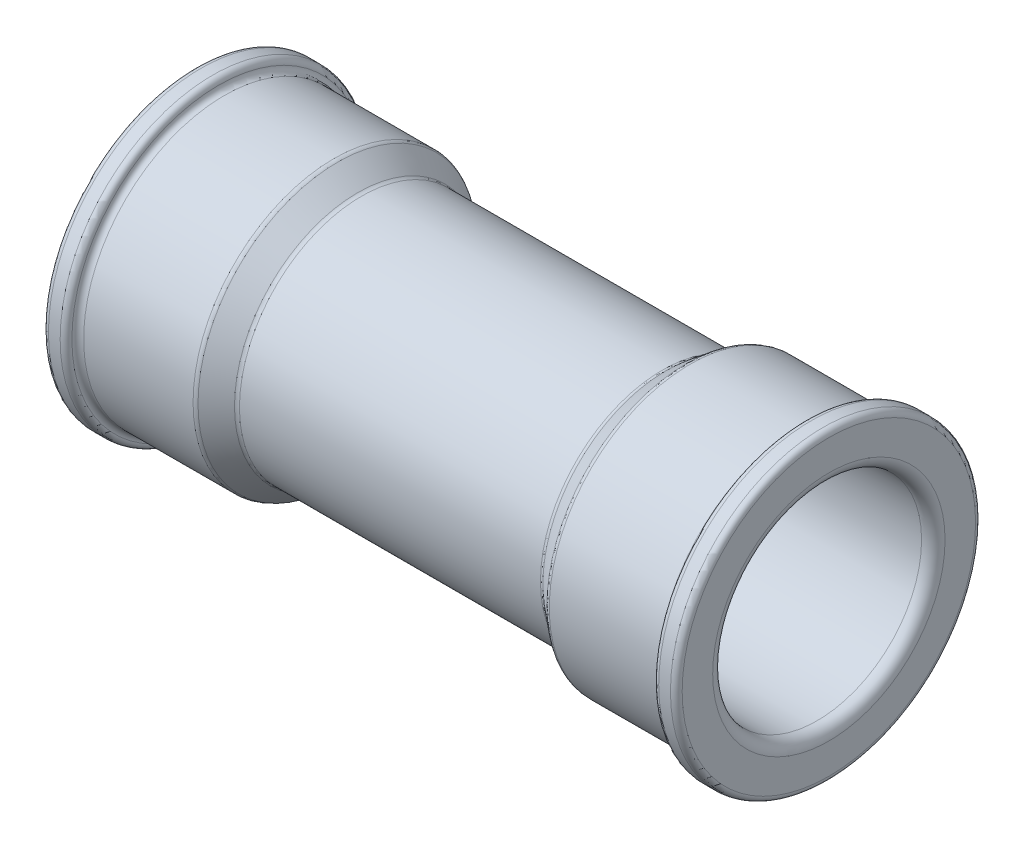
ISO-10303-21;
HEADER;
FILE_DESCRIPTION(('STEP AP214'),'2;1');
FILE_NAME('part.step','',(''),(''),'','','');
FILE_SCHEMA(('AUTOMOTIVE_DESIGN { 1 0 10303 214 1 1 1 1 }'));
ENDSEC;
DATA;
#1=APPLICATION_CONTEXT('core data for automotive mechanical design processes');
#2=APPLICATION_PROTOCOL_DEFINITION('international standard','automotive_design',2000,#1);
#3=PRODUCT_CONTEXT('',#1,'mechanical');
#4=PRODUCT('Part','Part','',(#3));
#5=PRODUCT_RELATED_PRODUCT_CATEGORY('part','',(#4));
#6=PRODUCT_DEFINITION_FORMATION('','',#4);
#7=PRODUCT_DEFINITION_CONTEXT('part definition',#1,'design');
#8=PRODUCT_DEFINITION('design','',#6,#7);
#9=PRODUCT_DEFINITION_SHAPE('','',#8);
#10=(LENGTH_UNIT() NAMED_UNIT(*) SI_UNIT(.MILLI.,.METRE.));
#11=(NAMED_UNIT(*) PLANE_ANGLE_UNIT() SI_UNIT($,.RADIAN.));
#12=(NAMED_UNIT(*) SI_UNIT($,.STERADIAN.) SOLID_ANGLE_UNIT());
#13=UNCERTAINTY_MEASURE_WITH_UNIT(LENGTH_MEASURE(1.E-05),#10,'distance_accuracy_value','');
#14=(GEOMETRIC_REPRESENTATION_CONTEXT(3) GLOBAL_UNCERTAINTY_ASSIGNED_CONTEXT((#13)) GLOBAL_UNIT_ASSIGNED_CONTEXT((#10,
#11,#12)) REPRESENTATION_CONTEXT('',''));
#15=CARTESIAN_POINT('',(0.,0.,0.));
#16=DIRECTION('',(0.,0.,1.));
#17=DIRECTION('',(1.,0.,0.));
#18=AXIS2_PLACEMENT_3D('',#15,#16,#17);
#19=CARTESIAN_POINT('',(0.,0.,0.));
#20=DIRECTION('',(1.,0.,0.));
#21=DIRECTION('',(0.,0.,-1.));
#22=AXIS2_PLACEMENT_3D('',#19,#20,#21);
#23=CYLINDRICAL_SURFACE('',#22,10.4);
#24=CARTESIAN_POINT('',(-12.8246094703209,0.,0.));
#25=DIRECTION('',(1.,0.,0.));
#26=DIRECTION('',(0.,0.,-1.));
#27=AXIS2_PLACEMENT_3D('',#24,#25,#26);
#28=CIRCLE('',#27,10.4);
#29=CARTESIAN_POINT('',(-12.8246094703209,0.,-10.4));
#30=VERTEX_POINT('',#29);
#31=EDGE_CURVE('E186',#30,#30,#28,.T.);
#32=ORIENTED_EDGE('',*,*,#31,.T.);
#33=EDGE_LOOP('',(#32));
#34=FACE_BOUND('',#33,.T.);
#35=CARTESIAN_POINT('',(12.8246094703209,0.,0.));
#36=DIRECTION('',(1.,0.,0.));
#37=DIRECTION('',(0.,0.,-1.));
#38=AXIS2_PLACEMENT_3D('',#35,#36,#37);
#39=CIRCLE('',#38,10.4);
#40=CARTESIAN_POINT('',(12.8246094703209,0.,-10.4));
#41=VERTEX_POINT('',#40);
#42=EDGE_CURVE('E189',#41,#41,#39,.F.);
#43=ORIENTED_EDGE('',*,*,#42,.T.);
#44=EDGE_LOOP('',(#43));
#45=FACE_BOUND('',#44,.T.);
#46=ADVANCED_FACE('F17',(#34,#45),#23,.T.);
#47=CARTESIAN_POINT('',(12.8246094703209,0.,0.));
#48=DIRECTION('',(1.,0.,0.));
#49=DIRECTION('',(0.,0.,-1.));
#50=AXIS2_PLACEMENT_3D('',#47,#48,#49);
#51=TOROIDAL_SURFACE('',#50,10.9,0.5);
#52=ORIENTED_EDGE('',*,*,#42,.F.);
#53=EDGE_LOOP('',(#52));
#54=FACE_BOUND('',#53,.T.);
#55=CARTESIAN_POINT('',(13.1369569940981,0.,0.));
#56=DIRECTION('',(1.,0.,0.));
#57=DIRECTION('',(0.,0.,-1.));
#58=AXIS2_PLACEMENT_3D('',#55,#56,#57);
#59=CIRCLE('',#58,10.5095655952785);
#60=CARTESIAN_POINT('',(13.1369569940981,0.,-10.5095655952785));
#61=VERTEX_POINT('',#60);
#62=EDGE_CURVE('E172',#61,#61,#59,.T.);
#63=ORIENTED_EDGE('',*,*,#62,.F.);
#64=EDGE_LOOP('',(#63));
#65=FACE_BOUND('',#64,.T.);
#66=ADVANCED_FACE('F180',(#54,#65),#51,.F.);
#67=CARTESIAN_POINT('',(-12.8246094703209,0.,0.));
#68=DIRECTION('',(1.,0.,0.));
#69=DIRECTION('',(0.,0.,-1.));
#70=AXIS2_PLACEMENT_3D('',#67,#68,#69);
#71=TOROIDAL_SURFACE('',#70,10.9,0.5);
#72=CARTESIAN_POINT('',(-13.1369569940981,0.,0.));
#73=DIRECTION('',(-1.,0.,0.));
#74=DIRECTION('',(0.,0.,1.));
#75=AXIS2_PLACEMENT_3D('',#72,#73,#74);
#76=CIRCLE('',#75,10.5095655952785);
#77=CARTESIAN_POINT('',(-13.1369569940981,0.,10.5095655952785));
#78=VERTEX_POINT('',#77);
#79=EDGE_CURVE('E169',#78,#78,#76,.T.);
#80=ORIENTED_EDGE('',*,*,#79,.F.);
#81=EDGE_LOOP('',(#80));
#82=FACE_BOUND('',#81,.T.);
#83=ORIENTED_EDGE('',*,*,#31,.F.);
#84=EDGE_LOOP('',(#83));
#85=FACE_BOUND('',#84,.T.);
#86=ADVANCED_FACE('F177',(#82,#85),#71,.F.);
#87=CARTESIAN_POINT('',(14.8630430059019,0.,0.));
#88=DIRECTION('',(1.,0.,0.));
#89=DIRECTION('',(0.,0.,-1.));
#90=AXIS2_PLACEMENT_3D('',#87,#88,#89);
#91=CONICAL_SURFACE('',#90,11.8904344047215,0.674740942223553);
#92=ORIENTED_EDGE('',*,*,#62,.T.);
#93=EDGE_LOOP('',(#92));
#94=FACE_BOUND('',#93,.T.);
#95=CARTESIAN_POINT('',(14.8630430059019,0.,0.));
#96=DIRECTION('',(-1.,0.,0.));
#97=DIRECTION('',(0.,0.,1.));
#98=AXIS2_PLACEMENT_3D('',#95,#96,#97);
#99=CIRCLE('',#98,11.8904344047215);
#100=CARTESIAN_POINT('',(14.8630430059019,0.,11.8904344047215));
#101=VERTEX_POINT('',#100);
#102=EDGE_CURVE('E166',#101,#101,#99,.F.);
#103=ORIENTED_EDGE('',*,*,#102,.F.);
#104=EDGE_LOOP('',(#103));
#105=FACE_BOUND('',#104,.T.);
#106=ADVANCED_FACE('F179',(#94,#105),#91,.T.);
#107=CARTESIAN_POINT('',(-14.8630430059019,0.,0.));
#108=DIRECTION('',(-1.,0.,0.));
#109=DIRECTION('',(0.,0.,1.));
#110=AXIS2_PLACEMENT_3D('',#107,#108,#109);
#111=CONICAL_SURFACE('',#110,11.8904344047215,0.674740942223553);
#112=ORIENTED_EDGE('',*,*,#79,.T.);
#113=EDGE_LOOP('',(#112));
#114=FACE_BOUND('',#113,.T.);
#115=CARTESIAN_POINT('',(-14.8630430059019,0.,0.));
#116=DIRECTION('',(-1.,0.,0.));
#117=DIRECTION('',(0.,0.,1.));
#118=AXIS2_PLACEMENT_3D('',#115,#116,#117);
#119=CIRCLE('',#118,11.8904344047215);
#120=CARTESIAN_POINT('',(-14.8630430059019,0.,11.8904344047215));
#121=VERTEX_POINT('',#120);
#122=EDGE_CURVE('E163',#121,#121,#119,.T.);
#123=ORIENTED_EDGE('',*,*,#122,.F.);
#124=EDGE_LOOP('',(#123));
#125=FACE_BOUND('',#124,.T.);
#126=ADVANCED_FACE('F157',(#114,#125),#111,.T.);
#127=CARTESIAN_POINT('',(15.1753905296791,0.,0.));
#128=DIRECTION('',(-1.,0.,0.));
#129=DIRECTION('',(0.,0.,1.));
#130=AXIS2_PLACEMENT_3D('',#127,#128,#129);
#131=TOROIDAL_SURFACE('',#130,11.5,0.5);
#132=CARTESIAN_POINT('',(15.1753905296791,0.,0.));
#133=DIRECTION('',(1.,0.,0.));
#134=DIRECTION('',(0.,0.,-1.));
#135=AXIS2_PLACEMENT_3D('',#132,#133,#134);
#136=CIRCLE('',#135,12.);
#137=CARTESIAN_POINT('',(15.1753905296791,0.,-12.));
#138=VERTEX_POINT('',#137);
#139=EDGE_CURVE('E162',#138,#138,#136,.T.);
#140=ORIENTED_EDGE('',*,*,#139,.F.);
#141=EDGE_LOOP('',(#140));
#142=FACE_BOUND('',#141,.T.);
#143=ORIENTED_EDGE('',*,*,#102,.T.);
#144=EDGE_LOOP('',(#143));
#145=FACE_BOUND('',#144,.T.);
#146=ADVANCED_FACE('F152',(#142,#145),#131,.T.);
#147=CARTESIAN_POINT('',(-15.1753905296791,0.,0.));
#148=DIRECTION('',(-1.,0.,0.));
#149=DIRECTION('',(0.,0.,1.));
#150=AXIS2_PLACEMENT_3D('',#147,#148,#149);
#151=TOROIDAL_SURFACE('',#150,11.5,0.5);
#152=ORIENTED_EDGE('',*,*,#122,.T.);
#153=EDGE_LOOP('',(#152));
#154=FACE_BOUND('',#153,.T.);
#155=CARTESIAN_POINT('',(-15.1753905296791,0.,0.));
#156=DIRECTION('',(1.,0.,0.));
#157=DIRECTION('',(0.,0.,-1.));
#158=AXIS2_PLACEMENT_3D('',#155,#156,#157);
#159=CIRCLE('',#158,12.);
#160=CARTESIAN_POINT('',(-15.1753905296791,0.,-12.));
#161=VERTEX_POINT('',#160);
#162=EDGE_CURVE('E143',#161,#161,#159,.F.);
#163=ORIENTED_EDGE('',*,*,#162,.F.);
#164=EDGE_LOOP('',(#163));
#165=FACE_BOUND('',#164,.T.);
#166=ADVANCED_FACE('F148',(#154,#165),#151,.T.);
#167=CARTESIAN_POINT('',(0.,0.,0.));
#168=DIRECTION('',(1.,0.,0.));
#169=DIRECTION('',(0.,0.,-1.));
#170=AXIS2_PLACEMENT_3D('',#167,#168,#169);
#171=CYLINDRICAL_SURFACE('',#170,12.);
#172=ORIENTED_EDGE('',*,*,#139,.T.);
#173=EDGE_LOOP('',(#172));
#174=FACE_BOUND('',#173,.T.);
#175=CARTESIAN_POINT('',(24.5,0.,0.));
#176=DIRECTION('',(-1.,0.,0.));
#177=DIRECTION('',(0.,0.,1.));
#178=AXIS2_PLACEMENT_3D('',#175,#176,#177);
#179=CIRCLE('',#178,12.);
#180=CARTESIAN_POINT('',(24.5,0.,12.));
#181=VERTEX_POINT('',#180);
#182=EDGE_CURVE('E140',#181,#181,#179,.T.);
#183=ORIENTED_EDGE('',*,*,#182,.T.);
#184=EDGE_LOOP('',(#183));
#185=FACE_BOUND('',#184,.T.);
#186=ADVANCED_FACE('F151',(#174,#185),#171,.T.);
#187=CARTESIAN_POINT('',(0.,0.,0.));
#188=DIRECTION('',(1.,0.,0.));
#189=DIRECTION('',(0.,0.,-1.));
#190=AXIS2_PLACEMENT_3D('',#187,#188,#189);
#191=CYLINDRICAL_SURFACE('',#190,12.);
#192=CARTESIAN_POINT('',(-24.5,0.,0.));
#193=DIRECTION('',(1.,0.,0.));
#194=DIRECTION('',(0.,0.,-1.));
#195=AXIS2_PLACEMENT_3D('',#192,#193,#194);
#196=CIRCLE('',#195,12.);
#197=CARTESIAN_POINT('',(-24.5,0.,-12.));
#198=VERTEX_POINT('',#197);
#199=EDGE_CURVE('E137',#198,#198,#196,.T.);
#200=ORIENTED_EDGE('',*,*,#199,.T.);
#201=EDGE_LOOP('',(#200));
#202=FACE_BOUND('',#201,.T.);
#203=ORIENTED_EDGE('',*,*,#162,.T.);
#204=EDGE_LOOP('',(#203));
#205=FACE_BOUND('',#204,.T.);
#206=ADVANCED_FACE('F129',(#202,#205),#191,.T.);
#207=CARTESIAN_POINT('',(24.5,0.,0.));
#208=DIRECTION('',(-1.,0.,0.));
#209=DIRECTION('',(0.,0.,1.));
#210=AXIS2_PLACEMENT_3D('',#207,#208,#209);
#211=TOROIDAL_SURFACE('',#210,12.5,0.5);
#212=CARTESIAN_POINT('',(25.,0.,0.));
#213=DIRECTION('',(-1.,0.,0.));
#214=DIRECTION('',(0.,0.,1.));
#215=AXIS2_PLACEMENT_3D('',#212,#213,#214);
#216=CIRCLE('',#215,12.5);
#217=CARTESIAN_POINT('',(25.,0.,12.5));
#218=VERTEX_POINT('',#217);
#219=EDGE_CURVE('E134',#218,#218,#216,.F.);
#220=ORIENTED_EDGE('',*,*,#219,.F.);
#221=EDGE_LOOP('',(#220));
#222=FACE_BOUND('',#221,.T.);
#223=ORIENTED_EDGE('',*,*,#182,.F.);
#224=EDGE_LOOP('',(#223));
#225=FACE_BOUND('',#224,.T.);
#226=ADVANCED_FACE('F125',(#222,#225),#211,.F.);
#227=CARTESIAN_POINT('',(-24.5,0.,0.));
#228=DIRECTION('',(1.,0.,0.));
#229=DIRECTION('',(0.,0.,-1.));
#230=AXIS2_PLACEMENT_3D('',#227,#228,#229);
#231=TOROIDAL_SURFACE('',#230,12.5,0.5);
#232=CARTESIAN_POINT('',(-25.,0.,0.));
#233=DIRECTION('',(1.,0.,0.));
#234=DIRECTION('',(0.,0.,-1.));
#235=AXIS2_PLACEMENT_3D('',#232,#233,#234);
#236=CIRCLE('',#235,12.5);
#237=CARTESIAN_POINT('',(-25.,0.,-12.5));
#238=VERTEX_POINT('',#237);
#239=EDGE_CURVE('E116',#238,#238,#236,.F.);
#240=ORIENTED_EDGE('',*,*,#239,.F.);
#241=EDGE_LOOP('',(#240));
#242=FACE_BOUND('',#241,.T.);
#243=ORIENTED_EDGE('',*,*,#199,.F.);
#244=EDGE_LOOP('',(#243));
#245=FACE_BOUND('',#244,.T.);
#246=ADVANCED_FACE('F122',(#242,#245),#231,.F.);
#247=CARTESIAN_POINT('',(25.5,0.,0.));
#248=DIRECTION('',(-1.,0.,0.));
#249=DIRECTION('',(0.,0.,1.));
#250=AXIS2_PLACEMENT_3D('',#247,#248,#249);
#251=TOROIDAL_SURFACE('',#250,12.5,0.5);
#252=CARTESIAN_POINT('',(25.5,0.,0.));
#253=DIRECTION('',(1.,0.,0.));
#254=DIRECTION('',(0.,0.,-1.));
#255=AXIS2_PLACEMENT_3D('',#252,#253,#254);
#256=CIRCLE('',#255,13.);
#257=CARTESIAN_POINT('',(25.5,0.,-13.));
#258=VERTEX_POINT('',#257);
#259=EDGE_CURVE('E114',#258,#258,#256,.T.);
#260=ORIENTED_EDGE('',*,*,#259,.F.);
#261=EDGE_LOOP('',(#260));
#262=FACE_BOUND('',#261,.T.);
#263=ORIENTED_EDGE('',*,*,#219,.T.);
#264=EDGE_LOOP('',(#263));
#265=FACE_BOUND('',#264,.T.);
#266=ADVANCED_FACE('F104',(#262,#265),#251,.T.);
#267=CARTESIAN_POINT('',(-25.5,0.,0.));
#268=DIRECTION('',(1.,0.,0.));
#269=DIRECTION('',(0.,0.,-1.));
#270=AXIS2_PLACEMENT_3D('',#267,#268,#269);
#271=TOROIDAL_SURFACE('',#270,12.5,0.5);
#272=CARTESIAN_POINT('',(-25.5,0.,0.));
#273=DIRECTION('',(1.,0.,0.));
#274=DIRECTION('',(0.,0.,-1.));
#275=AXIS2_PLACEMENT_3D('',#272,#273,#274);
#276=CIRCLE('',#275,13.);
#277=CARTESIAN_POINT('',(-25.5,0.,-13.));
#278=VERTEX_POINT('',#277);
#279=EDGE_CURVE('E111',#278,#278,#276,.F.);
#280=ORIENTED_EDGE('',*,*,#279,.F.);
#281=EDGE_LOOP('',(#280));
#282=FACE_BOUND('',#281,.T.);
#283=ORIENTED_EDGE('',*,*,#239,.T.);
#284=EDGE_LOOP('',(#283));
#285=FACE_BOUND('',#284,.T.);
#286=ADVANCED_FACE('F99',(#282,#285),#271,.T.);
#287=CARTESIAN_POINT('',(0.,0.,0.));
#288=DIRECTION('',(1.,0.,0.));
#289=DIRECTION('',(0.,0.,-1.));
#290=AXIS2_PLACEMENT_3D('',#287,#288,#289);
#291=CYLINDRICAL_SURFACE('',#290,13.);
#292=ORIENTED_EDGE('',*,*,#259,.T.);
#293=EDGE_LOOP('',(#292));
#294=FACE_BOUND('',#293,.T.);
#295=CARTESIAN_POINT('',(26.5,0.,0.));
#296=DIRECTION('',(1.,0.,0.));
#297=DIRECTION('',(0.,0.,-1.));
#298=AXIS2_PLACEMENT_3D('',#295,#296,#297);
#299=CIRCLE('',#298,13.);
#300=CARTESIAN_POINT('',(26.5,0.,-13.));
#301=VERTEX_POINT('',#300);
#302=EDGE_CURVE('E110',#301,#301,#299,.T.);
#303=ORIENTED_EDGE('',*,*,#302,.F.);
#304=EDGE_LOOP('',(#303));
#305=FACE_BOUND('',#304,.T.);
#306=ADVANCED_FACE('F95',(#294,#305),#291,.T.);
#307=CARTESIAN_POINT('',(0.,0.,0.));
#308=DIRECTION('',(1.,0.,0.));
#309=DIRECTION('',(0.,0.,-1.));
#310=AXIS2_PLACEMENT_3D('',#307,#308,#309);
#311=CYLINDRICAL_SURFACE('',#310,13.);
#312=CARTESIAN_POINT('',(-26.5,0.,0.));
#313=DIRECTION('',(-1.,0.,0.));
#314=DIRECTION('',(0.,0.,1.));
#315=AXIS2_PLACEMENT_3D('',#312,#313,#314);
#316=CIRCLE('',#315,13.);
#317=CARTESIAN_POINT('',(-26.5,0.,13.));
#318=VERTEX_POINT('',#317);
#319=EDGE_CURVE('E64',#318,#318,#316,.T.);
#320=ORIENTED_EDGE('',*,*,#319,.F.);
#321=EDGE_LOOP('',(#320));
#322=FACE_BOUND('',#321,.T.);
#323=ORIENTED_EDGE('',*,*,#279,.T.);
#324=EDGE_LOOP('',(#323));
#325=FACE_BOUND('',#324,.T.);
#326=ADVANCED_FACE('F87',(#322,#325),#311,.T.);
#327=CARTESIAN_POINT('',(26.5,0.,0.));
#328=DIRECTION('',(1.,0.,0.));
#329=DIRECTION('',(0.,0.,-1.));
#330=AXIS2_PLACEMENT_3D('',#327,#328,#329);
#331=TOROIDAL_SURFACE('',#330,12.5,0.5);
#332=ORIENTED_EDGE('',*,*,#302,.T.);
#333=EDGE_LOOP('',(#332));
#334=FACE_BOUND('',#333,.T.);
#335=CARTESIAN_POINT('',(27.,0.,0.));
#336=DIRECTION('',(-1.,0.,0.));
#337=DIRECTION('',(0.,0.,-1.));
#338=AXIS2_PLACEMENT_3D('',#335,#336,#337);
#339=CIRCLE('',#338,12.5);
#340=CARTESIAN_POINT('',(27.,0.,12.5));
#341=VERTEX_POINT('',#340);
#342=CARTESIAN_POINT('',(27.,0.,-12.5));
#343=VERTEX_POINT('',#342);
#344=EDGE_CURVE('E57',#341,#343,#339,.F.);
#345=ORIENTED_EDGE('',*,*,#344,.F.);
#346=CARTESIAN_POINT('',(27.,0.,0.));
#347=DIRECTION('',(-1.,0.,0.));
#348=DIRECTION('',(0.,0.,1.));
#349=AXIS2_PLACEMENT_3D('',#346,#347,#348);
#350=CIRCLE('',#349,12.5);
#351=EDGE_CURVE('E60',#343,#341,#350,.F.);
#352=ORIENTED_EDGE('',*,*,#351,.F.);
#353=EDGE_LOOP('',(#345,#352));
#354=FACE_BOUND('',#353,.T.);
#355=ADVANCED_FACE('F68',(#334,#354),#331,.T.);
#356=CARTESIAN_POINT('',(-26.5,0.,0.));
#357=DIRECTION('',(-1.,0.,0.));
#358=DIRECTION('',(0.,0.,1.));
#359=AXIS2_PLACEMENT_3D('',#356,#357,#358);
#360=TOROIDAL_SURFACE('',#359,12.5,0.5);
#361=ORIENTED_EDGE('',*,*,#319,.T.);
#362=EDGE_LOOP('',(#361));
#363=FACE_BOUND('',#362,.T.);
#364=CARTESIAN_POINT('',(-27.,0.,0.));
#365=DIRECTION('',(1.,0.,0.));
#366=DIRECTION('',(0.,0.,1.));
#367=AXIS2_PLACEMENT_3D('',#364,#365,#366);
#368=CIRCLE('',#367,12.5);
#369=CARTESIAN_POINT('',(-27.,0.,-12.5));
#370=VERTEX_POINT('',#369);
#371=CARTESIAN_POINT('',(-27.,0.,12.5));
#372=VERTEX_POINT('',#371);
#373=EDGE_CURVE('E237',#370,#372,#368,.F.);
#374=ORIENTED_EDGE('',*,*,#373,.F.);
#375=CARTESIAN_POINT('',(-27.,0.,0.));
#376=DIRECTION('',(1.,0.,0.));
#377=DIRECTION('',(0.,0.,-1.));
#378=AXIS2_PLACEMENT_3D('',#375,#376,#377);
#379=CIRCLE('',#378,12.5);
#380=EDGE_CURVE('E226',#372,#370,#379,.F.);
#381=ORIENTED_EDGE('',*,*,#380,.F.);
#382=EDGE_LOOP('',(#374,#381));
#383=FACE_BOUND('',#382,.T.);
#384=ADVANCED_FACE('F86',(#363,#383),#360,.T.);
#385=CARTESIAN_POINT('',(27.,0.,-8.9));
#386=DIRECTION('',(1.,0.,0.));
#387=DIRECTION('',(0.,0.,-1.));
#388=AXIS2_PLACEMENT_3D('',#385,#386,#387);
#389=PLANE('',#388);
#390=CARTESIAN_POINT('',(27.,0.,0.));
#391=DIRECTION('',(1.,0.,0.));
#392=DIRECTION('',(0.,0.,1.));
#393=AXIS2_PLACEMENT_3D('',#390,#391,#392);
#394=CIRCLE('',#393,9.9);
#395=CARTESIAN_POINT('',(27.,0.,9.9));
#396=VERTEX_POINT('',#395);
#397=CARTESIAN_POINT('',(27.,0.,-9.9));
#398=VERTEX_POINT('',#397);
#399=EDGE_CURVE('E272',#396,#398,#394,.T.);
#400=ORIENTED_EDGE('',*,*,#399,.F.);
#401=CARTESIAN_POINT('',(27.,0.,0.));
#402=DIRECTION('',(1.,0.,0.));
#403=DIRECTION('',(0.,0.,-1.));
#404=AXIS2_PLACEMENT_3D('',#401,#402,#403);
#405=CIRCLE('',#404,9.9);
#406=EDGE_CURVE('E69',#398,#396,#405,.T.);
#407=ORIENTED_EDGE('',*,*,#406,.F.);
#408=EDGE_LOOP('',(#400,#407));
#409=FACE_BOUND('',#408,.T.);
#410=ORIENTED_EDGE('',*,*,#351,.T.);
#411=ORIENTED_EDGE('',*,*,#344,.T.);
#412=EDGE_LOOP('',(#410,#411));
#413=FACE_BOUND('',#412,.T.);
#414=ADVANCED_FACE('F62',(#409,#413),#389,.T.);
#415=CARTESIAN_POINT('',(-27.,0.,-12.));
#416=DIRECTION('',(-1.,0.,0.));
#417=DIRECTION('',(0.,0.,1.));
#418=AXIS2_PLACEMENT_3D('',#415,#416,#417);
#419=PLANE('',#418);
#420=CARTESIAN_POINT('',(-27.,0.,0.));
#421=DIRECTION('',(-1.,0.,0.));
#422=DIRECTION('',(0.,0.,-1.));
#423=AXIS2_PLACEMENT_3D('',#420,#421,#422);
#424=CIRCLE('',#423,9.9);
#425=CARTESIAN_POINT('',(-27.,0.,-9.9));
#426=VERTEX_POINT('',#425);
#427=CARTESIAN_POINT('',(-27.,0.,9.9));
#428=VERTEX_POINT('',#427);
#429=EDGE_CURVE('E247',#426,#428,#424,.T.);
#430=ORIENTED_EDGE('',*,*,#429,.F.);
#431=CARTESIAN_POINT('',(-27.,0.,0.));
#432=DIRECTION('',(-1.,0.,0.));
#433=DIRECTION('',(0.,0.,1.));
#434=AXIS2_PLACEMENT_3D('',#431,#432,#433);
#435=CIRCLE('',#434,9.9);
#436=EDGE_CURVE('E36',#426,#428,#435,.F.);
#437=ORIENTED_EDGE('',*,*,#436,.T.);
#438=EDGE_LOOP('',(#430,#437));
#439=FACE_BOUND('',#438,.T.);
#440=ORIENTED_EDGE('',*,*,#380,.T.);
#441=ORIENTED_EDGE('',*,*,#373,.T.);
#442=EDGE_LOOP('',(#440,#441));
#443=FACE_BOUND('',#442,.T.);
#444=ADVANCED_FACE('F213',(#439,#443),#419,.T.);
#445=CARTESIAN_POINT('',(26.,0.,0.));
#446=DIRECTION('',(1.,0.,0.));
#447=DIRECTION('',(0.,0.,-1.));
#448=AXIS2_PLACEMENT_3D('',#445,#446,#447);
#449=TOROIDAL_SURFACE('',#448,9.9,1.);
#450=ORIENTED_EDGE('',*,*,#406,.T.);
#451=ORIENTED_EDGE('',*,*,#399,.T.);
#452=EDGE_LOOP('',(#450,#451));
#453=FACE_BOUND('',#452,.T.);
#454=CARTESIAN_POINT('',(26.,0.,0.));
#455=DIRECTION('',(1.,0.,0.));
#456=DIRECTION('',(0.,0.,-1.));
#457=AXIS2_PLACEMENT_3D('',#454,#455,#456);
#458=CIRCLE('',#457,8.9);
#459=CARTESIAN_POINT('',(26.,0.,-8.9));
#460=VERTEX_POINT('',#459);
#461=EDGE_CURVE('E28',#460,#460,#458,.F.);
#462=ORIENTED_EDGE('',*,*,#461,.T.);
#463=EDGE_LOOP('',(#462));
#464=FACE_BOUND('',#463,.T.);
#465=ADVANCED_FACE('F201',(#453,#464),#449,.T.);
#466=CARTESIAN_POINT('',(-26.,0.,0.));
#467=DIRECTION('',(-1.,0.,0.));
#468=DIRECTION('',(0.,0.,1.));
#469=AXIS2_PLACEMENT_3D('',#466,#467,#468);
#470=TOROIDAL_SURFACE('',#469,9.9,1.);
#471=CARTESIAN_POINT('',(-26.,0.,0.));
#472=DIRECTION('',(1.,0.,0.));
#473=DIRECTION('',(0.,0.,-1.));
#474=AXIS2_PLACEMENT_3D('',#471,#472,#473);
#475=CIRCLE('',#474,8.9);
#476=CARTESIAN_POINT('',(-26.,0.,-8.9));
#477=VERTEX_POINT('',#476);
#478=EDGE_CURVE('E11',#477,#477,#475,.T.);
#479=ORIENTED_EDGE('',*,*,#478,.T.);
#480=EDGE_LOOP('',(#479));
#481=FACE_BOUND('',#480,.T.);
#482=ORIENTED_EDGE('',*,*,#429,.T.);
#483=ORIENTED_EDGE('',*,*,#436,.F.);
#484=EDGE_LOOP('',(#482,#483));
#485=FACE_BOUND('',#484,.T.);
#486=ADVANCED_FACE('F212',(#481,#485),#470,.T.);
#487=CARTESIAN_POINT('',(0.,0.,0.));
#488=DIRECTION('',(1.,0.,0.));
#489=DIRECTION('',(0.,0.,-1.));
#490=AXIS2_PLACEMENT_3D('',#487,#488,#489);
#491=CYLINDRICAL_SURFACE('',#490,8.9);
#492=ORIENTED_EDGE('',*,*,#461,.F.);
#493=EDGE_LOOP('',(#492));
#494=FACE_BOUND('',#493,.T.);
#495=ORIENTED_EDGE('',*,*,#478,.F.);
#496=EDGE_LOOP('',(#495));
#497=FACE_BOUND('',#496,.T.);
#498=ADVANCED_FACE('F317',(#494,#497),#491,.F.);
#499=CLOSED_SHELL('',(#46,#66,#86,#106,#126,#146,#166,#186,#206,#226,#246,#266,#286,#306,#326,
#355,#384,#414,#444,#465,#486,#498));
#500=MANIFOLD_SOLID_BREP('B1',#499);
#501=ADVANCED_BREP_SHAPE_REPRESENTATION('',(#18,#500),#14);
#502=SHAPE_DEFINITION_REPRESENTATION(#9,#501);
ENDSEC;
END-ISO-10303-21;
